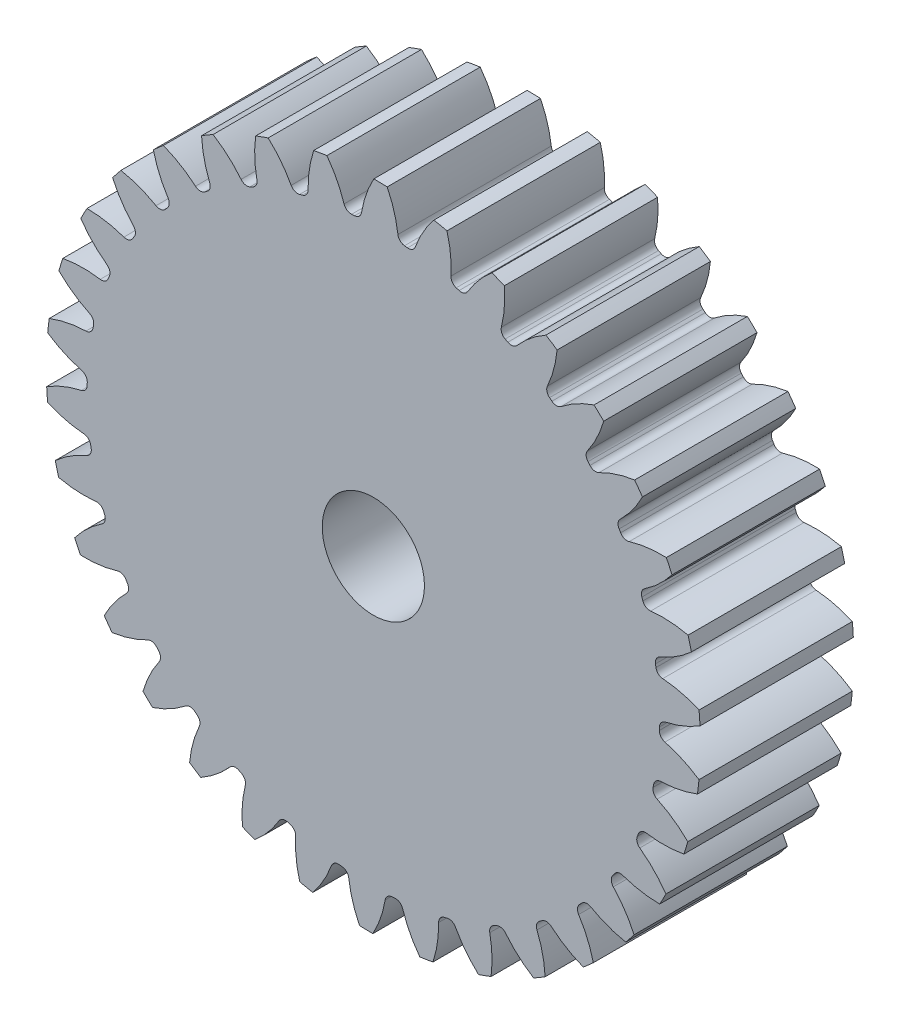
from build123d import *

# Parameters (mm, degrees)
SKETCH3_R         = 203.2
GEARBODY_DEPTH    = 95.25
TOOTHCUT_DEPTH    = 303.742535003
CIRPATTERN1_COUNT = 34
BOREDIA_R         = 31.75
BORE_DEPTH        = 12700


with BuildPart() as part:
    # Sketch3 → gearBody (new body)
    with BuildSketch(Plane.XY):
        Circle(SKETCH3_R)
    extrude(amount=GEARBODY_DEPTH)

    # Sketch2 → toothCut (cut, through all)
    with BuildSketch(Plane.XY):
        with BuildLine():
            ThreePointArc((177.734550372, -4.823857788), (177.757529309, -3.885971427), (177.775559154, -2.947976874))
            ThreePointArc((177.775559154, -2.947976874), (178.814285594, -0.113734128), (181.387570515, 1.464267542))
            ThreePointArc((181.387570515, 1.464267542), (192.674483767, 4.967340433), (203.2, 10.341299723))
            ThreePointArc((203.2, 10.341299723), (203.414374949, -4.446857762), (202.553943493, -19.211518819))
            ThreePointArc((202.553943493, -19.211518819), (192.273331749, -13.382715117), (181.150290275, -9.38973643))
            ThreePointArc((181.150290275, -9.38973643), (178.648424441, -7.700786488), (177.734550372, -4.823857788))
        make_face()
    toothcut = extrude(amount=TOOTHCUT_DEPTH, mode=Mode.SUBTRACT)

    # CirPattern1: toothCut ×34 about axis
    cirpattern1_axis = Axis((0, 0, 0), (0, 0, 1))
    for i in range(1, CIRPATTERN1_COUNT):
        add(toothcut.rotate(cirpattern1_axis, i * 360 / CIRPATTERN1_COUNT), mode=Mode.SUBTRACT)

    # boreDia → bore (cut, symmetric)
    with BuildSketch(Plane.XY):
        Circle(BOREDIA_R)
    extrude(amount=BORE_DEPTH, both=True, mode=Mode.SUBTRACT)


solid = part.part
